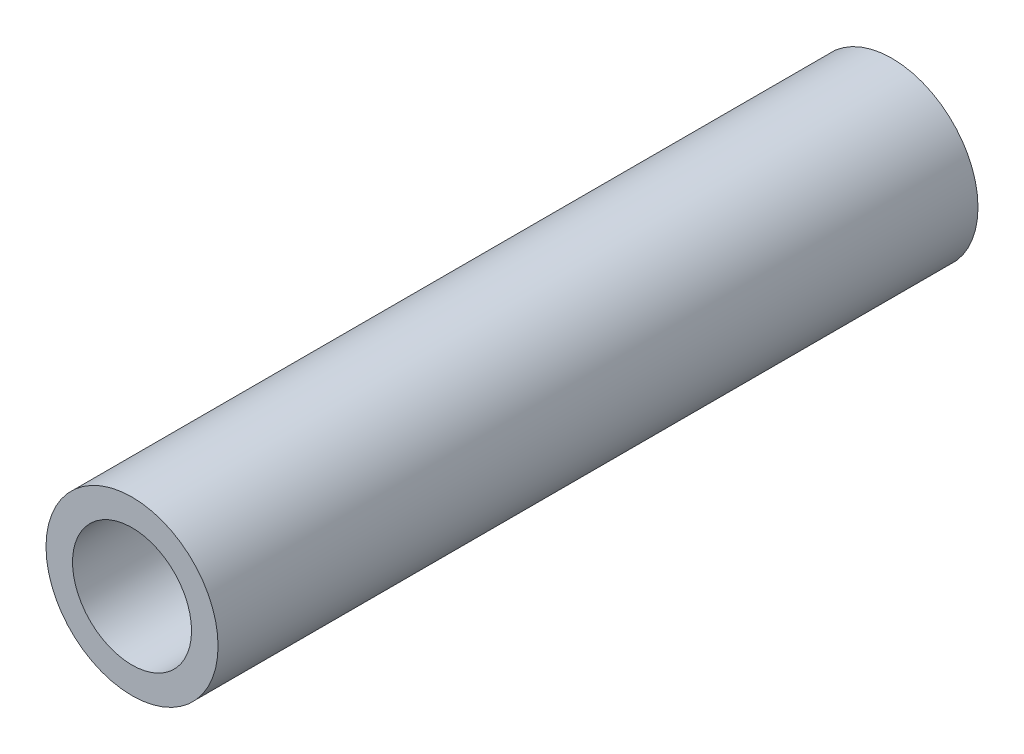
from build123d import *

# Parameters (mm, degrees)
ESQUISSE1_R      = 6
ESQUISSE1_R_2    = 4.15
EXTRUSION1_DEPTH = 26.5


with BuildPart() as part:
    # Esquisse1 → Extrusion1 (new, symmetric)
    with BuildSketch(Plane.XY):
        with Locations((190, -10)):
            Circle(ESQUISSE1_R)
        with Locations((190, -10)):
            Circle(ESQUISSE1_R_2, mode=Mode.SUBTRACT)
    extrude(amount=EXTRUSION1_DEPTH, both=True)


solid = part.part
